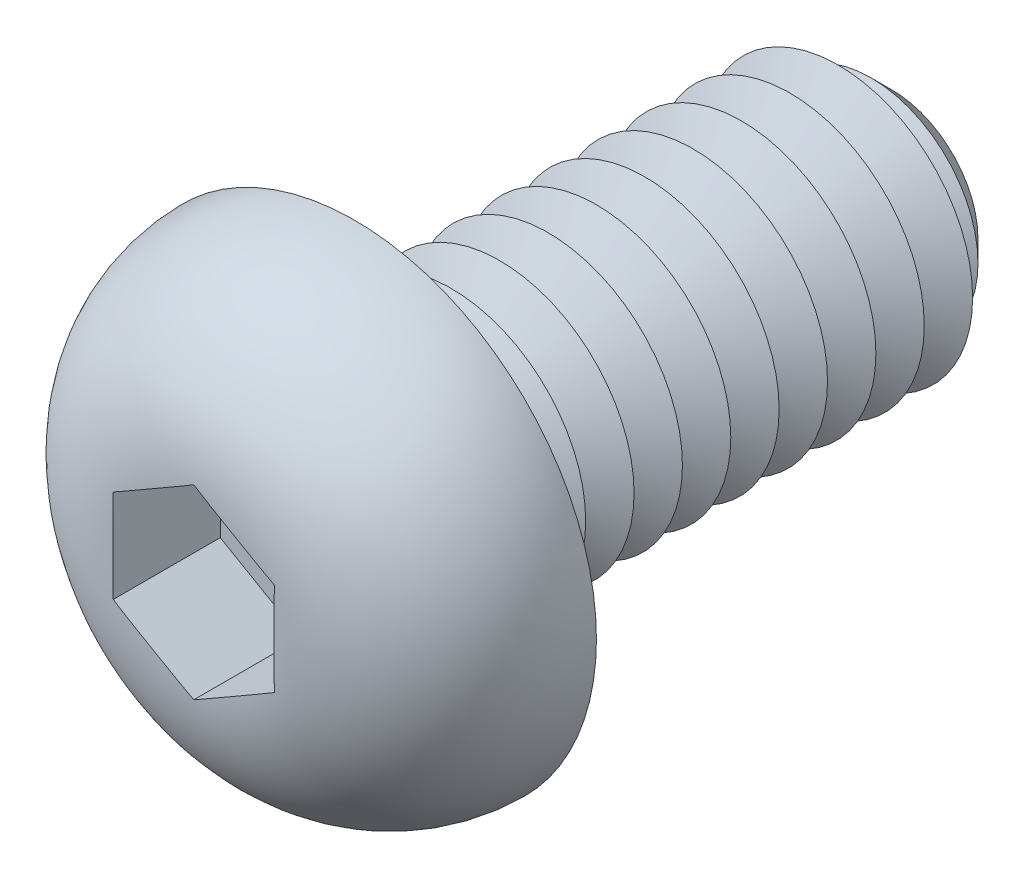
from build123d import *

# Parameters (mm, degrees)
CUT_EXTRUDE1_DEPTH  = 1
SKETCH4_R           = 1.25
BOSS_EXTRUDE1_DEPTH = 5
CHAMFER1_SIZE       = 0.45
LPATTERN1_COUNT     = 10
LPATTERN1_PITCH     = 0.45
FILLET2_R           = 0.225
SKETCH6_R           = 0.45
CUT_EXTRUDE2_DEPTH  = 5.5


with BuildPart() as part:
    # Sketch2 → Revolve1 (revolve)
    with BuildSketch(Plane(origin=(0, 0, 0), x_dir=(0, 0, -1), z_dir=(1, 0, 0)), mode=Mode.PRIVATE) as revolve1_sk:
        with BuildLine():
            Line((0, 0), (-1.5, 0))
            Line((-1.5, 0), (-1.5, 0.75))
            ThreePointArc((-1.5, 0.75), (-1.060660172, 1.810660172), (0, 2.25))
            Line((0, 2.25), (0, 0))
        make_face()
    revolve(revolve1_sk.sketch.rotate(Axis((0, 0, 47.934239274), (0, 0, -1)), 90), axis=Axis((0, 0, 47.934239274), (0, 0, -1)))

    # Sketch3 → Cut-Extrude1 (cut)
    with BuildSketch(Plane.XY.offset(1.5)):
        Polygon((0, 0.866025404), (-0.75, 0.433012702), (-0.75, -0.433012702), (0, -0.866025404), (0.75, -0.433012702), (0.75, 0.433012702), align=None)
    extrude(amount=-CUT_EXTRUDE1_DEPTH, mode=Mode.SUBTRACT)

    # Sketch4 → Boss-Extrude1 (add)
    with BuildSketch(Plane(origin=(0, 0, 0), x_dir=(-1, 0, 0), z_dir=(0, 0, -1))):
        with Locations(Location((0, 0, 0), (0, 0, 180))):
            Circle(SKETCH4_R)
    extrude(amount=BOSS_EXTRUDE1_DEPTH)

    # Chamfer1
    chamfer1_edges = [part.edges().sort_by_distance(p)[0] for p in [
        (-1.25, 0, -5),
    ]]
    chamfer(chamfer1_edges, length=CHAMFER1_SIZE)

    # Sketch5 → Cut-Revolve1 (revolve, cut)
    with BuildSketch(Plane(origin=(0, 0, 0), x_dir=(0, 0, -1), z_dir=(1, 0, 0)), mode=Mode.PRIVATE) as cut_revolve1_sk:
        Polygon((0.45, 1.25), (0.9, 1.25), (0.675, 0.860288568), align=None)
    cut_revolve1 = revolve(cut_revolve1_sk.sketch.rotate(Axis((0, 0, 47.934239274), (0, 0, -1)), 90), axis=Axis((0, 0, 47.934239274), (0, 0, -1)), mode=Mode.SUBTRACT)

    # LPattern1: Cut-Revolve1 ×10
    with Locations(*[(0, 0, -i * LPATTERN1_PITCH) for i in range(1, LPATTERN1_COUNT)]):
        add(cut_revolve1, mode=Mode.SUBTRACT)

    # Fillet2
    fillet2_edges = [part.edges().sort_by_distance(p)[0] for p in [
        (-1.25, 0, 0),
    ]]
    fillet(fillet2_edges, radius=FILLET2_R)

    # Sketch6 → Cut-Extrude2 (cut)
    with BuildSketch(Plane.XY.offset(0.5)):
        Circle(SKETCH6_R)
    extrude(amount=-CUT_EXTRUDE2_DEPTH, mode=Mode.SUBTRACT)


solid = part.part
